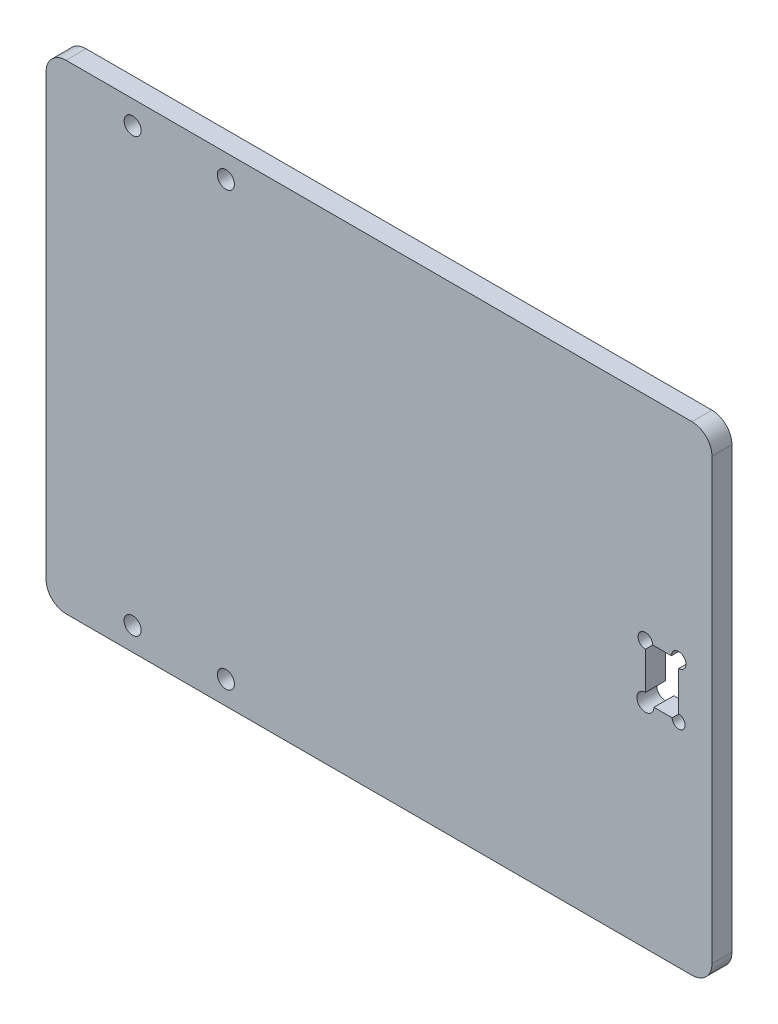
ISO-10303-21;
HEADER;
FILE_DESCRIPTION(('STEP AP214'),'2;1');
FILE_NAME('part.step','',(''),(''),'','','');
FILE_SCHEMA(('AUTOMOTIVE_DESIGN { 1 0 10303 214 1 1 1 1 }'));
ENDSEC;
DATA;
#1=APPLICATION_CONTEXT('core data for automotive mechanical design processes');
#2=APPLICATION_PROTOCOL_DEFINITION('international standard','automotive_design',2000,#1);
#3=PRODUCT_CONTEXT('',#1,'mechanical');
#4=PRODUCT('Part','Part','',(#3));
#5=PRODUCT_RELATED_PRODUCT_CATEGORY('part','',(#4));
#6=PRODUCT_DEFINITION_FORMATION('','',#4);
#7=PRODUCT_DEFINITION_CONTEXT('part definition',#1,'design');
#8=PRODUCT_DEFINITION('design','',#6,#7);
#9=PRODUCT_DEFINITION_SHAPE('','',#8);
#10=(LENGTH_UNIT() NAMED_UNIT(*) SI_UNIT(.MILLI.,.METRE.));
#11=(NAMED_UNIT(*) PLANE_ANGLE_UNIT() SI_UNIT($,.RADIAN.));
#12=(NAMED_UNIT(*) SI_UNIT($,.STERADIAN.) SOLID_ANGLE_UNIT());
#13=UNCERTAINTY_MEASURE_WITH_UNIT(LENGTH_MEASURE(1.E-05),#10,'distance_accuracy_value','');
#14=(GEOMETRIC_REPRESENTATION_CONTEXT(3) GLOBAL_UNCERTAINTY_ASSIGNED_CONTEXT((#13)) GLOBAL_UNIT_ASSIGNED_CONTEXT((#10,
#11,#12)) REPRESENTATION_CONTEXT('',''));
#15=CARTESIAN_POINT('',(0.,0.,0.));
#16=DIRECTION('',(0.,0.,1.));
#17=DIRECTION('',(1.,0.,0.));
#18=AXIS2_PLACEMENT_3D('',#15,#16,#17);
#19=CARTESIAN_POINT('',(3.,69.,3.));
#20=DIRECTION('',(0.,0.,-1.));
#21=DIRECTION('',(-1.,0.,0.));
#22=AXIS2_PLACEMENT_3D('',#19,#20,#21);
#23=CYLINDRICAL_SURFACE('',#22,3.);
#24=CARTESIAN_POINT('',(3.,69.,0.));
#25=DIRECTION('',(0.,0.,1.));
#26=DIRECTION('',(1.,0.,0.));
#27=AXIS2_PLACEMENT_3D('',#24,#25,#26);
#28=CIRCLE('',#27,3.);
#29=CARTESIAN_POINT('',(3.,72.,0.));
#30=VERTEX_POINT('',#29);
#31=CARTESIAN_POINT('',(0.,69.,0.));
#32=VERTEX_POINT('',#31);
#33=EDGE_CURVE('E179',#30,#32,#28,.T.);
#34=ORIENTED_EDGE('',*,*,#33,.T.);
#35=DIRECTION('',(0.,0.,-1.));
#36=VECTOR('',#35,1.);
#37=CARTESIAN_POINT('',(0.,69.,3.));
#38=LINE('',#37,#36);
#39=CARTESIAN_POINT('',(0.,69.,3.));
#40=VERTEX_POINT('',#39);
#41=EDGE_CURVE('E234',#40,#32,#38,.T.);
#42=ORIENTED_EDGE('',*,*,#41,.F.);
#43=CARTESIAN_POINT('',(3.,69.,3.));
#44=DIRECTION('',(0.,0.,1.));
#45=DIRECTION('',(1.,0.,0.));
#46=AXIS2_PLACEMENT_3D('',#43,#44,#45);
#47=CIRCLE('',#46,3.);
#48=CARTESIAN_POINT('',(3.,72.,3.));
#49=VERTEX_POINT('',#48);
#50=EDGE_CURVE('E196',#49,#40,#47,.T.);
#51=ORIENTED_EDGE('',*,*,#50,.F.);
#52=DIRECTION('',(0.,0.,-1.));
#53=VECTOR('',#52,1.);
#54=CARTESIAN_POINT('',(3.,72.,3.));
#55=LINE('',#54,#53);
#56=EDGE_CURVE('E213',#49,#30,#55,.T.);
#57=ORIENTED_EDGE('',*,*,#56,.T.);
#58=EDGE_LOOP('',(#34,#42,#51,#57));
#59=FACE_BOUND('',#58,.T.);
#60=ADVANCED_FACE('F27',(#59),#23,.T.);
#61=CARTESIAN_POINT('',(0.,3.00000000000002,3.));
#62=DIRECTION('',(1.,0.,0.));
#63=DIRECTION('',(0.,0.,-1.));
#64=AXIS2_PLACEMENT_3D('',#61,#62,#63);
#65=PLANE('',#64);
#66=DIRECTION('',(0.,-1.,0.));
#67=VECTOR('',#66,1.);
#68=CARTESIAN_POINT('',(0.,3.00000000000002,0.));
#69=LINE('',#68,#67);
#70=CARTESIAN_POINT('',(0.,3.00000000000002,0.));
#71=VERTEX_POINT('',#70);
#72=EDGE_CURVE('E182',#32,#71,#69,.T.);
#73=ORIENTED_EDGE('',*,*,#72,.T.);
#74=DIRECTION('',(0.,0.,-1.));
#75=VECTOR('',#74,1.);
#76=CARTESIAN_POINT('',(0.,3.00000000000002,3.));
#77=LINE('',#76,#75);
#78=CARTESIAN_POINT('',(0.,3.00000000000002,3.));
#79=VERTEX_POINT('',#78);
#80=EDGE_CURVE('E231',#79,#71,#77,.T.);
#81=ORIENTED_EDGE('',*,*,#80,.F.);
#82=DIRECTION('',(0.,-1.,0.));
#83=VECTOR('',#82,1.);
#84=CARTESIAN_POINT('',(0.,3.00000000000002,3.));
#85=LINE('',#84,#83);
#86=EDGE_CURVE('E199',#40,#79,#85,.T.);
#87=ORIENTED_EDGE('',*,*,#86,.F.);
#88=ORIENTED_EDGE('',*,*,#41,.T.);
#89=EDGE_LOOP('',(#73,#81,#87,#88));
#90=FACE_BOUND('',#89,.T.);
#91=ADVANCED_FACE('F307',(#90),#65,.F.);
#92=CARTESIAN_POINT('',(3.,3.,3.));
#93=DIRECTION('',(0.,0.,-1.));
#94=DIRECTION('',(-1.,0.,0.));
#95=AXIS2_PLACEMENT_3D('',#92,#93,#94);
#96=CYLINDRICAL_SURFACE('',#95,3.);
#97=CARTESIAN_POINT('',(3.,3.,0.));
#98=DIRECTION('',(0.,0.,1.));
#99=DIRECTION('',(1.,0.,0.));
#100=AXIS2_PLACEMENT_3D('',#97,#98,#99);
#101=CIRCLE('',#100,3.);
#102=CARTESIAN_POINT('',(3.00000000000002,0.,0.));
#103=VERTEX_POINT('',#102);
#104=EDGE_CURVE('E184',#71,#103,#101,.T.);
#105=ORIENTED_EDGE('',*,*,#104,.T.);
#106=DIRECTION('',(0.,0.,-1.));
#107=VECTOR('',#106,1.);
#108=CARTESIAN_POINT('',(3.00000000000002,0.,3.));
#109=LINE('',#108,#107);
#110=CARTESIAN_POINT('',(3.00000000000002,0.,3.));
#111=VERTEX_POINT('',#110);
#112=EDGE_CURVE('E228',#111,#103,#109,.T.);
#113=ORIENTED_EDGE('',*,*,#112,.F.);
#114=CARTESIAN_POINT('',(3.,3.,3.));
#115=DIRECTION('',(0.,0.,1.));
#116=DIRECTION('',(1.,0.,0.));
#117=AXIS2_PLACEMENT_3D('',#114,#115,#116);
#118=CIRCLE('',#117,3.);
#119=EDGE_CURVE('E201',#79,#111,#118,.T.);
#120=ORIENTED_EDGE('',*,*,#119,.F.);
#121=ORIENTED_EDGE('',*,*,#80,.T.);
#122=EDGE_LOOP('',(#105,#113,#120,#121));
#123=FACE_BOUND('',#122,.T.);
#124=ADVANCED_FACE('F312',(#123),#96,.T.);
#125=CARTESIAN_POINT('',(3.00000000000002,0.,3.));
#126=DIRECTION('',(0.,1.,0.));
#127=DIRECTION('',(0.,0.,1.));
#128=AXIS2_PLACEMENT_3D('',#125,#126,#127);
#129=PLANE('',#128);
#130=DIRECTION('',(1.,0.,0.));
#131=VECTOR('',#130,1.);
#132=CARTESIAN_POINT('',(3.00000000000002,0.,0.));
#133=LINE('',#132,#131);
#134=CARTESIAN_POINT('',(97.,0.,0.));
#135=VERTEX_POINT('',#134);
#136=EDGE_CURVE('E186',#103,#135,#133,.T.);
#137=ORIENTED_EDGE('',*,*,#136,.T.);
#138=DIRECTION('',(0.,0.,-1.));
#139=VECTOR('',#138,1.);
#140=CARTESIAN_POINT('',(97.,0.,3.));
#141=LINE('',#140,#139);
#142=CARTESIAN_POINT('',(97.,0.,3.));
#143=VERTEX_POINT('',#142);
#144=EDGE_CURVE('E225',#143,#135,#141,.T.);
#145=ORIENTED_EDGE('',*,*,#144,.F.);
#146=DIRECTION('',(1.,0.,0.));
#147=VECTOR('',#146,1.);
#148=CARTESIAN_POINT('',(3.00000000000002,0.,3.));
#149=LINE('',#148,#147);
#150=EDGE_CURVE('E203',#111,#143,#149,.T.);
#151=ORIENTED_EDGE('',*,*,#150,.F.);
#152=ORIENTED_EDGE('',*,*,#112,.T.);
#153=EDGE_LOOP('',(#137,#145,#151,#152));
#154=FACE_BOUND('',#153,.T.);
#155=ADVANCED_FACE('F318',(#154),#129,.F.);
#156=CARTESIAN_POINT('',(97.,3.,3.));
#157=DIRECTION('',(0.,0.,-1.));
#158=DIRECTION('',(-1.,0.,0.));
#159=AXIS2_PLACEMENT_3D('',#156,#157,#158);
#160=CYLINDRICAL_SURFACE('',#159,3.);
#161=CARTESIAN_POINT('',(97.,3.,0.));
#162=DIRECTION('',(0.,0.,1.));
#163=DIRECTION('',(1.,0.,0.));
#164=AXIS2_PLACEMENT_3D('',#161,#162,#163);
#165=CIRCLE('',#164,3.);
#166=CARTESIAN_POINT('',(100.,3.,0.));
#167=VERTEX_POINT('',#166);
#168=EDGE_CURVE('E188',#135,#167,#165,.T.);
#169=ORIENTED_EDGE('',*,*,#168,.T.);
#170=DIRECTION('',(0.,0.,-1.));
#171=VECTOR('',#170,1.);
#172=CARTESIAN_POINT('',(100.,3.,3.));
#173=LINE('',#172,#171);
#174=CARTESIAN_POINT('',(100.,3.,3.));
#175=VERTEX_POINT('',#174);
#176=EDGE_CURVE('E222',#175,#167,#173,.T.);
#177=ORIENTED_EDGE('',*,*,#176,.F.);
#178=CARTESIAN_POINT('',(97.,3.,3.));
#179=DIRECTION('',(0.,0.,1.));
#180=DIRECTION('',(1.,0.,0.));
#181=AXIS2_PLACEMENT_3D('',#178,#179,#180);
#182=CIRCLE('',#181,3.);
#183=EDGE_CURVE('E205',#143,#175,#182,.T.);
#184=ORIENTED_EDGE('',*,*,#183,.F.);
#185=ORIENTED_EDGE('',*,*,#144,.T.);
#186=EDGE_LOOP('',(#169,#177,#184,#185));
#187=FACE_BOUND('',#186,.T.);
#188=ADVANCED_FACE('F322',(#187),#160,.T.);
#189=CARTESIAN_POINT('',(100.,3.,3.));
#190=DIRECTION('',(-1.,0.,0.));
#191=DIRECTION('',(0.,0.,1.));
#192=AXIS2_PLACEMENT_3D('',#189,#190,#191);
#193=PLANE('',#192);
#194=DIRECTION('',(0.,1.,0.));
#195=VECTOR('',#194,1.);
#196=CARTESIAN_POINT('',(100.,3.,0.));
#197=LINE('',#196,#195);
#198=CARTESIAN_POINT('',(100.,69.,0.));
#199=VERTEX_POINT('',#198);
#200=EDGE_CURVE('E190',#167,#199,#197,.T.);
#201=ORIENTED_EDGE('',*,*,#200,.T.);
#202=DIRECTION('',(0.,0.,-1.));
#203=VECTOR('',#202,1.);
#204=CARTESIAN_POINT('',(100.,69.,3.));
#205=LINE('',#204,#203);
#206=CARTESIAN_POINT('',(100.,69.,3.));
#207=VERTEX_POINT('',#206);
#208=EDGE_CURVE('E219',#207,#199,#205,.T.);
#209=ORIENTED_EDGE('',*,*,#208,.F.);
#210=DIRECTION('',(0.,1.,0.));
#211=VECTOR('',#210,1.);
#212=CARTESIAN_POINT('',(100.,3.,3.));
#213=LINE('',#212,#211);
#214=EDGE_CURVE('E207',#175,#207,#213,.T.);
#215=ORIENTED_EDGE('',*,*,#214,.F.);
#216=ORIENTED_EDGE('',*,*,#176,.T.);
#217=EDGE_LOOP('',(#201,#209,#215,#216));
#218=FACE_BOUND('',#217,.T.);
#219=ADVANCED_FACE('F327',(#218),#193,.F.);
#220=CARTESIAN_POINT('',(97.,69.,3.));
#221=DIRECTION('',(0.,0.,-1.));
#222=DIRECTION('',(-1.,0.,0.));
#223=AXIS2_PLACEMENT_3D('',#220,#221,#222);
#224=CYLINDRICAL_SURFACE('',#223,3.);
#225=CARTESIAN_POINT('',(97.,69.,0.));
#226=DIRECTION('',(0.,0.,1.));
#227=DIRECTION('',(1.,0.,0.));
#228=AXIS2_PLACEMENT_3D('',#225,#226,#227);
#229=CIRCLE('',#228,3.);
#230=CARTESIAN_POINT('',(97.,72.,0.));
#231=VERTEX_POINT('',#230);
#232=EDGE_CURVE('E192',#199,#231,#229,.T.);
#233=ORIENTED_EDGE('',*,*,#232,.T.);
#234=DIRECTION('',(0.,0.,-1.));
#235=VECTOR('',#234,1.);
#236=CARTESIAN_POINT('',(97.,72.,3.));
#237=LINE('',#236,#235);
#238=CARTESIAN_POINT('',(97.,72.,3.));
#239=VERTEX_POINT('',#238);
#240=EDGE_CURVE('E216',#239,#231,#237,.T.);
#241=ORIENTED_EDGE('',*,*,#240,.F.);
#242=CARTESIAN_POINT('',(97.,69.,3.));
#243=DIRECTION('',(0.,0.,1.));
#244=DIRECTION('',(1.,0.,0.));
#245=AXIS2_PLACEMENT_3D('',#242,#243,#244);
#246=CIRCLE('',#245,3.);
#247=EDGE_CURVE('E209',#207,#239,#246,.T.);
#248=ORIENTED_EDGE('',*,*,#247,.F.);
#249=ORIENTED_EDGE('',*,*,#208,.T.);
#250=EDGE_LOOP('',(#233,#241,#248,#249));
#251=FACE_BOUND('',#250,.T.);
#252=ADVANCED_FACE('F331',(#251),#224,.T.);
#253=CARTESIAN_POINT('',(3.,72.,3.));
#254=DIRECTION('',(0.,-1.,0.));
#255=DIRECTION('',(0.,0.,-1.));
#256=AXIS2_PLACEMENT_3D('',#253,#254,#255);
#257=PLANE('',#256);
#258=DIRECTION('',(-1.,0.,0.));
#259=VECTOR('',#258,1.);
#260=CARTESIAN_POINT('',(3.,72.,0.));
#261=LINE('',#260,#259);
#262=EDGE_CURVE('E194',#231,#30,#261,.T.);
#263=ORIENTED_EDGE('',*,*,#262,.T.);
#264=ORIENTED_EDGE('',*,*,#56,.F.);
#265=DIRECTION('',(-1.,0.,0.));
#266=VECTOR('',#265,1.);
#267=CARTESIAN_POINT('',(3.,72.,3.));
#268=LINE('',#267,#266);
#269=EDGE_CURVE('E211',#239,#49,#268,.T.);
#270=ORIENTED_EDGE('',*,*,#269,.F.);
#271=ORIENTED_EDGE('',*,*,#240,.T.);
#272=EDGE_LOOP('',(#263,#264,#270,#271));
#273=FACE_BOUND('',#272,.T.);
#274=ADVANCED_FACE('F297',(#273),#257,.F.);
#275=CARTESIAN_POINT('',(3.,69.,3.));
#276=DIRECTION('',(0.,0.,1.));
#277=DIRECTION('',(1.,0.,0.));
#278=AXIS2_PLACEMENT_3D('',#275,#276,#277);
#279=PLANE('',#278);
#280=CARTESIAN_POINT('',(90.,32.,3.));
#281=DIRECTION('',(0.,0.,1.));
#282=DIRECTION('',(1.,0.,0.));
#283=AXIS2_PLACEMENT_3D('',#280,#281,#282);
#284=CIRCLE('',#283,1.28841174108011);
#285=CARTESIAN_POINT('',(90.,33.2884117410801,3.));
#286=VERTEX_POINT('',#285);
#287=CARTESIAN_POINT('',(91.2884117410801,32.,3.));
#288=VERTEX_POINT('',#287);
#289=EDGE_CURVE('E41',#286,#288,#284,.T.);
#290=ORIENTED_EDGE('',*,*,#289,.F.);
#291=DIRECTION('',(0.,-1.,0.));
#292=VECTOR('',#291,1.);
#293=CARTESIAN_POINT('',(90.,40.,3.));
#294=LINE('',#293,#292);
#295=CARTESIAN_POINT('',(90.,38.9018973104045,3.));
#296=VERTEX_POINT('',#295);
#297=EDGE_CURVE('E153',#296,#286,#294,.T.);
#298=ORIENTED_EDGE('',*,*,#297,.F.);
#299=CARTESIAN_POINT('',(90.,40.,3.));
#300=DIRECTION('',(0.,0.,1.));
#301=DIRECTION('',(1.,0.,0.));
#302=AXIS2_PLACEMENT_3D('',#299,#300,#301);
#303=CIRCLE('',#302,1.0981026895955);
#304=CARTESIAN_POINT('',(91.0981026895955,40.,3.));
#305=VERTEX_POINT('',#304);
#306=EDGE_CURVE('E266',#305,#296,#303,.T.);
#307=ORIENTED_EDGE('',*,*,#306,.F.);
#308=DIRECTION('',(-1.,0.,0.));
#309=VECTOR('',#308,1.);
#310=CARTESIAN_POINT('',(90.,40.,3.));
#311=LINE('',#310,#309);
#312=CARTESIAN_POINT('',(93.9,40.,3.));
#313=VERTEX_POINT('',#312);
#314=EDGE_CURVE('E170',#313,#305,#311,.T.);
#315=ORIENTED_EDGE('',*,*,#314,.F.);
#316=CARTESIAN_POINT('',(95.,40.,3.));
#317=DIRECTION('',(0.,0.,1.));
#318=DIRECTION('',(1.,0.,0.));
#319=AXIS2_PLACEMENT_3D('',#316,#317,#318);
#320=CIRCLE('',#319,1.10000000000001);
#321=CARTESIAN_POINT('',(95.,38.9,3.));
#322=VERTEX_POINT('',#321);
#323=EDGE_CURVE('E258',#322,#313,#320,.T.);
#324=ORIENTED_EDGE('',*,*,#323,.F.);
#325=DIRECTION('',(0.,1.,0.));
#326=VECTOR('',#325,1.);
#327=CARTESIAN_POINT('',(95.,40.,3.));
#328=LINE('',#327,#326);
#329=CARTESIAN_POINT('',(95.,32.9787492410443,3.));
#330=VERTEX_POINT('',#329);
#331=EDGE_CURVE('E162',#330,#322,#328,.T.);
#332=ORIENTED_EDGE('',*,*,#331,.F.);
#333=CARTESIAN_POINT('',(95.,32.,3.));
#334=DIRECTION('',(0.,0.,1.));
#335=DIRECTION('',(1.,0.,0.));
#336=AXIS2_PLACEMENT_3D('',#333,#334,#335);
#337=CIRCLE('',#336,0.978749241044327);
#338=CARTESIAN_POINT('',(94.0212507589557,32.,3.));
#339=VERTEX_POINT('',#338);
#340=EDGE_CURVE('E145',#339,#330,#337,.T.);
#341=ORIENTED_EDGE('',*,*,#340,.F.);
#342=DIRECTION('',(1.,0.,0.));
#343=VECTOR('',#342,1.);
#344=CARTESIAN_POINT('',(90.,32.,3.));
#345=LINE('',#344,#343);
#346=EDGE_CURVE('E155',#288,#339,#345,.T.);
#347=ORIENTED_EDGE('',*,*,#346,.F.);
#348=EDGE_LOOP('',(#290,#298,#307,#315,#324,#332,#341,#347));
#349=FACE_BOUND('',#348,.T.);
#350=CARTESIAN_POINT('',(13.,3.5,3.));
#351=DIRECTION('',(0.,0.,1.));
#352=DIRECTION('',(1.,0.,0.));
#353=AXIS2_PLACEMENT_3D('',#350,#351,#352);
#354=CIRCLE('',#353,1.28157121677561);
#355=CARTESIAN_POINT('',(14.2815712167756,3.5,3.));
#356=VERTEX_POINT('',#355);
#357=EDGE_CURVE('E272',#356,#356,#354,.T.);
#358=ORIENTED_EDGE('',*,*,#357,.F.);
#359=EDGE_LOOP('',(#358));
#360=FACE_BOUND('',#359,.T.);
#361=CARTESIAN_POINT('',(27.,3.5,3.));
#362=DIRECTION('',(0.,0.,1.));
#363=DIRECTION('',(1.,0.,0.));
#364=AXIS2_PLACEMENT_3D('',#361,#362,#363);
#365=CIRCLE('',#364,1.2815712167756);
#366=CARTESIAN_POINT('',(28.2815712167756,3.5,3.));
#367=VERTEX_POINT('',#366);
#368=EDGE_CURVE('E278',#367,#367,#365,.T.);
#369=ORIENTED_EDGE('',*,*,#368,.F.);
#370=EDGE_LOOP('',(#369));
#371=FACE_BOUND('',#370,.T.);
#372=CARTESIAN_POINT('',(27.,68.5,3.));
#373=DIRECTION('',(0.,0.,1.));
#374=DIRECTION('',(1.,0.,0.));
#375=AXIS2_PLACEMENT_3D('',#372,#373,#374);
#376=CIRCLE('',#375,1.2815712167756);
#377=CARTESIAN_POINT('',(28.2815712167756,68.5,3.));
#378=VERTEX_POINT('',#377);
#379=EDGE_CURVE('E284',#378,#378,#376,.T.);
#380=ORIENTED_EDGE('',*,*,#379,.F.);
#381=EDGE_LOOP('',(#380));
#382=FACE_BOUND('',#381,.T.);
#383=CARTESIAN_POINT('',(13.,68.5,3.));
#384=DIRECTION('',(0.,0.,1.));
#385=DIRECTION('',(1.,0.,0.));
#386=AXIS2_PLACEMENT_3D('',#383,#384,#385);
#387=CIRCLE('',#386,1.2815712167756);
#388=CARTESIAN_POINT('',(14.2815712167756,68.5,3.));
#389=VERTEX_POINT('',#388);
#390=EDGE_CURVE('E165',#389,#389,#387,.T.);
#391=ORIENTED_EDGE('',*,*,#390,.F.);
#392=EDGE_LOOP('',(#391));
#393=FACE_BOUND('',#392,.T.);
#394=ORIENTED_EDGE('',*,*,#50,.T.);
#395=ORIENTED_EDGE('',*,*,#86,.T.);
#396=ORIENTED_EDGE('',*,*,#119,.T.);
#397=ORIENTED_EDGE('',*,*,#150,.T.);
#398=ORIENTED_EDGE('',*,*,#183,.T.);
#399=ORIENTED_EDGE('',*,*,#214,.T.);
#400=ORIENTED_EDGE('',*,*,#247,.T.);
#401=ORIENTED_EDGE('',*,*,#269,.T.);
#402=EDGE_LOOP('',(#394,#395,#396,#397,#398,#399,#400,#401));
#403=FACE_BOUND('',#402,.T.);
#404=ADVANCED_FACE('F150',(#349,#360,#371,#382,#393,#403),#279,.T.);
#405=CARTESIAN_POINT('',(3.,69.,0.));
#406=DIRECTION('',(0.,0.,1.));
#407=DIRECTION('',(1.,0.,0.));
#408=AXIS2_PLACEMENT_3D('',#405,#406,#407);
#409=PLANE('',#408);
#410=CARTESIAN_POINT('',(13.,3.5,0.));
#411=DIRECTION('',(0.,0.,1.));
#412=DIRECTION('',(1.,0.,0.));
#413=AXIS2_PLACEMENT_3D('',#410,#411,#412);
#414=CIRCLE('',#413,1.28157121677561);
#415=CARTESIAN_POINT('',(14.2815712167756,3.5,0.));
#416=VERTEX_POINT('',#415);
#417=EDGE_CURVE('E275',#416,#416,#414,.T.);
#418=ORIENTED_EDGE('',*,*,#417,.T.);
#419=EDGE_LOOP('',(#418));
#420=FACE_BOUND('',#419,.T.);
#421=CARTESIAN_POINT('',(27.,3.5,0.));
#422=DIRECTION('',(0.,0.,1.));
#423=DIRECTION('',(1.,0.,0.));
#424=AXIS2_PLACEMENT_3D('',#421,#422,#423);
#425=CIRCLE('',#424,1.2815712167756);
#426=CARTESIAN_POINT('',(28.2815712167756,3.5,0.));
#427=VERTEX_POINT('',#426);
#428=EDGE_CURVE('E281',#427,#427,#425,.T.);
#429=ORIENTED_EDGE('',*,*,#428,.T.);
#430=EDGE_LOOP('',(#429));
#431=FACE_BOUND('',#430,.T.);
#432=CARTESIAN_POINT('',(27.,68.5,0.));
#433=DIRECTION('',(0.,0.,1.));
#434=DIRECTION('',(1.,0.,0.));
#435=AXIS2_PLACEMENT_3D('',#432,#433,#434);
#436=CIRCLE('',#435,1.2815712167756);
#437=CARTESIAN_POINT('',(28.2815712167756,68.5,0.));
#438=VERTEX_POINT('',#437);
#439=EDGE_CURVE('E287',#438,#438,#436,.T.);
#440=ORIENTED_EDGE('',*,*,#439,.T.);
#441=EDGE_LOOP('',(#440));
#442=FACE_BOUND('',#441,.T.);
#443=CARTESIAN_POINT('',(13.,68.5,0.));
#444=DIRECTION('',(0.,0.,1.));
#445=DIRECTION('',(1.,0.,0.));
#446=AXIS2_PLACEMENT_3D('',#443,#444,#445);
#447=CIRCLE('',#446,1.2815712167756);
#448=CARTESIAN_POINT('',(14.2815712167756,68.5,0.));
#449=VERTEX_POINT('',#448);
#450=EDGE_CURVE('E160',#449,#449,#447,.T.);
#451=ORIENTED_EDGE('',*,*,#450,.T.);
#452=EDGE_LOOP('',(#451));
#453=FACE_BOUND('',#452,.T.);
#454=DIRECTION('',(0.,-1.,0.));
#455=VECTOR('',#454,1.);
#456=CARTESIAN_POINT('',(90.,40.,0.));
#457=LINE('',#456,#455);
#458=CARTESIAN_POINT('',(90.,38.9018973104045,0.));
#459=VERTEX_POINT('',#458);
#460=CARTESIAN_POINT('',(90.,33.2884117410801,0.));
#461=VERTEX_POINT('',#460);
#462=EDGE_CURVE('E172',#459,#461,#457,.T.);
#463=ORIENTED_EDGE('',*,*,#462,.T.);
#464=CARTESIAN_POINT('',(90.,32.,0.));
#465=DIRECTION('',(0.,0.,1.));
#466=DIRECTION('',(1.,0.,0.));
#467=AXIS2_PLACEMENT_3D('',#464,#465,#466);
#468=CIRCLE('',#467,1.28841174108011);
#469=CARTESIAN_POINT('',(91.2884117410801,32.,0.));
#470=VERTEX_POINT('',#469);
#471=EDGE_CURVE('E140',#461,#470,#468,.T.);
#472=ORIENTED_EDGE('',*,*,#471,.T.);
#473=DIRECTION('',(1.,0.,0.));
#474=VECTOR('',#473,1.);
#475=CARTESIAN_POINT('',(90.,32.,0.));
#476=LINE('',#475,#474);
#477=CARTESIAN_POINT('',(94.0212507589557,32.,0.));
#478=VERTEX_POINT('',#477);
#479=EDGE_CURVE('E48',#470,#478,#476,.T.);
#480=ORIENTED_EDGE('',*,*,#479,.T.);
#481=CARTESIAN_POINT('',(95.,32.,0.));
#482=DIRECTION('',(0.,0.,1.));
#483=DIRECTION('',(1.,0.,0.));
#484=AXIS2_PLACEMENT_3D('',#481,#482,#483);
#485=CIRCLE('',#484,0.978749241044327);
#486=CARTESIAN_POINT('',(95.,32.9787492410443,0.));
#487=VERTEX_POINT('',#486);
#488=EDGE_CURVE('E249',#478,#487,#485,.T.);
#489=ORIENTED_EDGE('',*,*,#488,.T.);
#490=DIRECTION('',(0.,1.,0.));
#491=VECTOR('',#490,1.);
#492=CARTESIAN_POINT('',(95.,40.,0.));
#493=LINE('',#492,#491);
#494=CARTESIAN_POINT('',(95.,38.9,0.));
#495=VERTEX_POINT('',#494);
#496=EDGE_CURVE('E175',#487,#495,#493,.T.);
#497=ORIENTED_EDGE('',*,*,#496,.T.);
#498=CARTESIAN_POINT('',(95.,40.,0.));
#499=DIRECTION('',(0.,0.,1.));
#500=DIRECTION('',(1.,0.,0.));
#501=AXIS2_PLACEMENT_3D('',#498,#499,#500);
#502=CIRCLE('',#501,1.10000000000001);
#503=CARTESIAN_POINT('',(93.9,40.,0.));
#504=VERTEX_POINT('',#503);
#505=EDGE_CURVE('E260',#495,#504,#502,.T.);
#506=ORIENTED_EDGE('',*,*,#505,.T.);
#507=DIRECTION('',(-1.,0.,0.));
#508=VECTOR('',#507,1.);
#509=CARTESIAN_POINT('',(90.,40.,0.));
#510=LINE('',#509,#508);
#511=CARTESIAN_POINT('',(91.0981026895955,40.,0.));
#512=VERTEX_POINT('',#511);
#513=EDGE_CURVE('E177',#504,#512,#510,.T.);
#514=ORIENTED_EDGE('',*,*,#513,.T.);
#515=CARTESIAN_POINT('',(90.,40.,0.));
#516=DIRECTION('',(0.,0.,1.));
#517=DIRECTION('',(1.,0.,0.));
#518=AXIS2_PLACEMENT_3D('',#515,#516,#517);
#519=CIRCLE('',#518,1.0981026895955);
#520=EDGE_CURVE('E268',#512,#459,#519,.T.);
#521=ORIENTED_EDGE('',*,*,#520,.T.);
#522=EDGE_LOOP('',(#463,#472,#480,#489,#497,#506,#514,#521));
#523=FACE_BOUND('',#522,.T.);
#524=ORIENTED_EDGE('',*,*,#33,.F.);
#525=ORIENTED_EDGE('',*,*,#262,.F.);
#526=ORIENTED_EDGE('',*,*,#232,.F.);
#527=ORIENTED_EDGE('',*,*,#200,.F.);
#528=ORIENTED_EDGE('',*,*,#168,.F.);
#529=ORIENTED_EDGE('',*,*,#136,.F.);
#530=ORIENTED_EDGE('',*,*,#104,.F.);
#531=ORIENTED_EDGE('',*,*,#72,.F.);
#532=EDGE_LOOP('',(#524,#525,#526,#527,#528,#529,#530,#531));
#533=FACE_BOUND('',#532,.T.);
#534=ADVANCED_FACE('F296',(#420,#431,#442,#453,#523,#533),#409,.F.);
#535=CARTESIAN_POINT('',(90.,40.,0.));
#536=DIRECTION('',(-1.,0.,0.));
#537=DIRECTION('',(0.,0.,1.));
#538=AXIS2_PLACEMENT_3D('',#535,#536,#537);
#539=PLANE('',#538);
#540=ORIENTED_EDGE('',*,*,#297,.T.);
#541=DIRECTION('',(0.,0.,1.));
#542=VECTOR('',#541,1.);
#543=CARTESIAN_POINT('',(90.,33.2884117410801,0.));
#544=LINE('',#543,#542);
#545=EDGE_CURVE('E138',#286,#461,#544,.F.);
#546=ORIENTED_EDGE('',*,*,#545,.T.);
#547=ORIENTED_EDGE('',*,*,#462,.F.);
#548=DIRECTION('',(0.,0.,1.));
#549=VECTOR('',#548,1.);
#550=CARTESIAN_POINT('',(90.,38.9018973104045,0.));
#551=LINE('',#550,#549);
#552=EDGE_CURVE('E159',#459,#296,#551,.T.);
#553=ORIENTED_EDGE('',*,*,#552,.T.);
#554=EDGE_LOOP('',(#540,#546,#547,#553));
#555=FACE_BOUND('',#554,.T.);
#556=ADVANCED_FACE('F158',(#555),#539,.F.);
#557=CARTESIAN_POINT('',(90.,40.,0.));
#558=DIRECTION('',(0.,1.,0.));
#559=DIRECTION('',(0.,0.,1.));
#560=AXIS2_PLACEMENT_3D('',#557,#558,#559);
#561=PLANE('',#560);
#562=ORIENTED_EDGE('',*,*,#513,.F.);
#563=DIRECTION('',(0.,0.,1.));
#564=VECTOR('',#563,1.);
#565=CARTESIAN_POINT('',(93.9,40.,0.));
#566=LINE('',#565,#564);
#567=EDGE_CURVE('E263',#504,#313,#566,.T.);
#568=ORIENTED_EDGE('',*,*,#567,.T.);
#569=ORIENTED_EDGE('',*,*,#314,.T.);
#570=DIRECTION('',(0.,0.,1.));
#571=VECTOR('',#570,1.);
#572=CARTESIAN_POINT('',(91.0981026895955,40.,0.));
#573=LINE('',#572,#571);
#574=EDGE_CURVE('E237',#305,#512,#573,.F.);
#575=ORIENTED_EDGE('',*,*,#574,.T.);
#576=EDGE_LOOP('',(#562,#568,#569,#575));
#577=FACE_BOUND('',#576,.T.);
#578=ADVANCED_FACE('F342',(#577),#561,.F.);
#579=CARTESIAN_POINT('',(95.,40.,0.));
#580=DIRECTION('',(1.,0.,0.));
#581=DIRECTION('',(0.,0.,-1.));
#582=AXIS2_PLACEMENT_3D('',#579,#580,#581);
#583=PLANE('',#582);
#584=ORIENTED_EDGE('',*,*,#496,.F.);
#585=DIRECTION('',(0.,0.,1.));
#586=VECTOR('',#585,1.);
#587=CARTESIAN_POINT('',(95.,32.9787492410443,0.));
#588=LINE('',#587,#586);
#589=EDGE_CURVE('E253',#487,#330,#588,.T.);
#590=ORIENTED_EDGE('',*,*,#589,.T.);
#591=ORIENTED_EDGE('',*,*,#331,.T.);
#592=DIRECTION('',(0.,0.,1.));
#593=VECTOR('',#592,1.);
#594=CARTESIAN_POINT('',(95.,38.9,0.));
#595=LINE('',#594,#593);
#596=EDGE_CURVE('E240',#322,#495,#595,.F.);
#597=ORIENTED_EDGE('',*,*,#596,.T.);
#598=EDGE_LOOP('',(#584,#590,#591,#597));
#599=FACE_BOUND('',#598,.T.);
#600=ADVANCED_FACE('F384',(#599),#583,.F.);
#601=CARTESIAN_POINT('',(90.,32.,0.));
#602=DIRECTION('',(0.,-1.,0.));
#603=DIRECTION('',(0.,0.,-1.));
#604=AXIS2_PLACEMENT_3D('',#601,#602,#603);
#605=PLANE('',#604);
#606=ORIENTED_EDGE('',*,*,#479,.F.);
#607=DIRECTION('',(0.,0.,1.));
#608=VECTOR('',#607,1.);
#609=CARTESIAN_POINT('',(91.2884117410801,32.,0.));
#610=LINE('',#609,#608);
#611=EDGE_CURVE('E11',#470,#288,#610,.T.);
#612=ORIENTED_EDGE('',*,*,#611,.T.);
#613=ORIENTED_EDGE('',*,*,#346,.T.);
#614=DIRECTION('',(0.,0.,1.));
#615=VECTOR('',#614,1.);
#616=CARTESIAN_POINT('',(94.0212507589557,32.,0.));
#617=LINE('',#616,#615);
#618=EDGE_CURVE('E34',#339,#478,#617,.F.);
#619=ORIENTED_EDGE('',*,*,#618,.T.);
#620=EDGE_LOOP('',(#606,#612,#613,#619));
#621=FACE_BOUND('',#620,.T.);
#622=ADVANCED_FACE('F245',(#621),#605,.F.);
#623=CARTESIAN_POINT('',(13.,68.5,0.));
#624=DIRECTION('',(0.,0.,1.));
#625=DIRECTION('',(1.,0.,0.));
#626=AXIS2_PLACEMENT_3D('',#623,#624,#625);
#627=CYLINDRICAL_SURFACE('',#626,1.2815712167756);
#628=ORIENTED_EDGE('',*,*,#450,.F.);
#629=EDGE_LOOP('',(#628));
#630=FACE_BOUND('',#629,.T.);
#631=ORIENTED_EDGE('',*,*,#390,.T.);
#632=EDGE_LOOP('',(#631));
#633=FACE_BOUND('',#632,.T.);
#634=ADVANCED_FACE('F292',(#630,#633),#627,.F.);
#635=CARTESIAN_POINT('',(27.,68.5,0.));
#636=DIRECTION('',(0.,0.,1.));
#637=DIRECTION('',(1.,0.,0.));
#638=AXIS2_PLACEMENT_3D('',#635,#636,#637);
#639=CYLINDRICAL_SURFACE('',#638,1.2815712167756);
#640=ORIENTED_EDGE('',*,*,#439,.F.);
#641=EDGE_LOOP('',(#640));
#642=FACE_BOUND('',#641,.T.);
#643=ORIENTED_EDGE('',*,*,#379,.T.);
#644=EDGE_LOOP('',(#643));
#645=FACE_BOUND('',#644,.T.);
#646=ADVANCED_FACE('F405',(#642,#645),#639,.F.);
#647=CARTESIAN_POINT('',(27.,3.5,0.));
#648=DIRECTION('',(0.,0.,1.));
#649=DIRECTION('',(1.,0.,0.));
#650=AXIS2_PLACEMENT_3D('',#647,#648,#649);
#651=CYLINDRICAL_SURFACE('',#650,1.2815712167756);
#652=ORIENTED_EDGE('',*,*,#428,.F.);
#653=EDGE_LOOP('',(#652));
#654=FACE_BOUND('',#653,.T.);
#655=ORIENTED_EDGE('',*,*,#368,.T.);
#656=EDGE_LOOP('',(#655));
#657=FACE_BOUND('',#656,.T.);
#658=ADVANCED_FACE('F413',(#654,#657),#651,.F.);
#659=CARTESIAN_POINT('',(13.,3.5,0.));
#660=DIRECTION('',(0.,0.,1.));
#661=DIRECTION('',(1.,0.,0.));
#662=AXIS2_PLACEMENT_3D('',#659,#660,#661);
#663=CYLINDRICAL_SURFACE('',#662,1.28157121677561);
#664=ORIENTED_EDGE('',*,*,#417,.F.);
#665=EDGE_LOOP('',(#664));
#666=FACE_BOUND('',#665,.T.);
#667=ORIENTED_EDGE('',*,*,#357,.T.);
#668=EDGE_LOOP('',(#667));
#669=FACE_BOUND('',#668,.T.);
#670=ADVANCED_FACE('F421',(#666,#669),#663,.F.);
#671=CARTESIAN_POINT('',(90.,40.,0.));
#672=DIRECTION('',(0.,0.,1.));
#673=DIRECTION('',(1.,0.,0.));
#674=AXIS2_PLACEMENT_3D('',#671,#672,#673);
#675=CYLINDRICAL_SURFACE('',#674,1.0981026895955);
#676=ORIENTED_EDGE('',*,*,#520,.F.);
#677=ORIENTED_EDGE('',*,*,#574,.F.);
#678=ORIENTED_EDGE('',*,*,#306,.T.);
#679=ORIENTED_EDGE('',*,*,#552,.F.);
#680=EDGE_LOOP('',(#676,#677,#678,#679));
#681=FACE_BOUND('',#680,.T.);
#682=ADVANCED_FACE('F429',(#681),#675,.F.);
#683=CARTESIAN_POINT('',(95.,40.,0.));
#684=DIRECTION('',(0.,0.,1.));
#685=DIRECTION('',(1.,0.,0.));
#686=AXIS2_PLACEMENT_3D('',#683,#684,#685);
#687=CYLINDRICAL_SURFACE('',#686,1.10000000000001);
#688=ORIENTED_EDGE('',*,*,#505,.F.);
#689=ORIENTED_EDGE('',*,*,#596,.F.);
#690=ORIENTED_EDGE('',*,*,#323,.T.);
#691=ORIENTED_EDGE('',*,*,#567,.F.);
#692=EDGE_LOOP('',(#688,#689,#690,#691));
#693=FACE_BOUND('',#692,.T.);
#694=ADVANCED_FACE('F437',(#693),#687,.F.);
#695=CARTESIAN_POINT('',(95.,32.,0.));
#696=DIRECTION('',(0.,0.,1.));
#697=DIRECTION('',(1.,0.,0.));
#698=AXIS2_PLACEMENT_3D('',#695,#696,#697);
#699=CYLINDRICAL_SURFACE('',#698,0.978749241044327);
#700=ORIENTED_EDGE('',*,*,#488,.F.);
#701=ORIENTED_EDGE('',*,*,#618,.F.);
#702=ORIENTED_EDGE('',*,*,#340,.T.);
#703=ORIENTED_EDGE('',*,*,#589,.F.);
#704=EDGE_LOOP('',(#700,#701,#702,#703));
#705=FACE_BOUND('',#704,.T.);
#706=ADVANCED_FACE('F247',(#705),#699,.F.);
#707=CARTESIAN_POINT('',(90.,32.,0.));
#708=DIRECTION('',(0.,0.,1.));
#709=DIRECTION('',(1.,0.,0.));
#710=AXIS2_PLACEMENT_3D('',#707,#708,#709);
#711=CYLINDRICAL_SURFACE('',#710,1.28841174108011);
#712=ORIENTED_EDGE('',*,*,#289,.T.);
#713=ORIENTED_EDGE('',*,*,#611,.F.);
#714=ORIENTED_EDGE('',*,*,#471,.F.);
#715=ORIENTED_EDGE('',*,*,#545,.F.);
#716=EDGE_LOOP('',(#712,#713,#714,#715));
#717=FACE_BOUND('',#716,.T.);
#718=ADVANCED_FACE('F139',(#717),#711,.F.);
#719=CLOSED_SHELL('',(#60,#91,#124,#155,#188,#219,#252,#274,#404,#534,#556,#578,#600,#622,#634,
#646,#658,#670,#682,#694,#706,#718));
#720=MANIFOLD_SOLID_BREP('B2',#719);
#721=ADVANCED_BREP_SHAPE_REPRESENTATION('',(#18,#720),#14);
#722=SHAPE_DEFINITION_REPRESENTATION(#9,#721);
ENDSEC;
END-ISO-10303-21;
